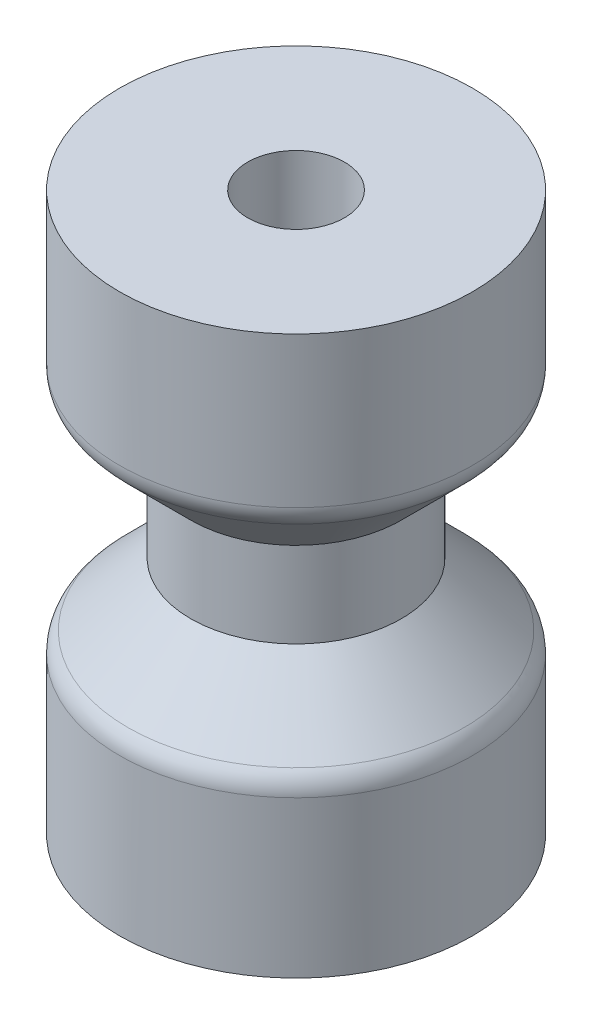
from build123d import *

# Parameters (mm, degrees)
SKETCH_1_R      = 6.2
SKETCH_1_R_2    = 1.7
EXTRUDE_1_DEPTH = 19.6
FILLET_1_R      = 1


with BuildPart() as part:
    # Sketch 1 → Extrude 1 (new body)
    with BuildSketch(Plane(origin=(0, 0, 0), x_dir=(1, 0, 0), z_dir=(0, 1, 0))):
        with Locations(Location((0, 0, 0), (0, 0, 270))):
            Circle(SKETCH_1_R)
        with Locations(Location((0, 0, 0), (0, 0, 270))):
            Circle(SKETCH_1_R_2, mode=Mode.SUBTRACT)
    extrude(amount=EXTRUDE_1_DEPTH)

    # Sketch 4 → Cut-Revolve 1 (revolve, cut)
    with BuildSketch(Plane(origin=(0, 0, 0), x_dir=(0, 0, -1), z_dir=(1, 0, 0))):
        Polygon((-6.2, 13.9), (-6.2, 5.9), (-3.7, 8.4), (-3.7, 11.4), align=None)
    revolve(axis=Axis((0, 33.080467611, 0), (0, -1, 0)), mode=Mode.SUBTRACT)

    # Fillet 1
    fillet_1_edges = [part.edges().sort_by_distance(p)[0] for p in [
        (0, 13.9, -6.2),
        (0, 5.9, -6.2),
    ]]
    fillet(fillet_1_edges, radius=FILLET_1_R)


solid = part.part
